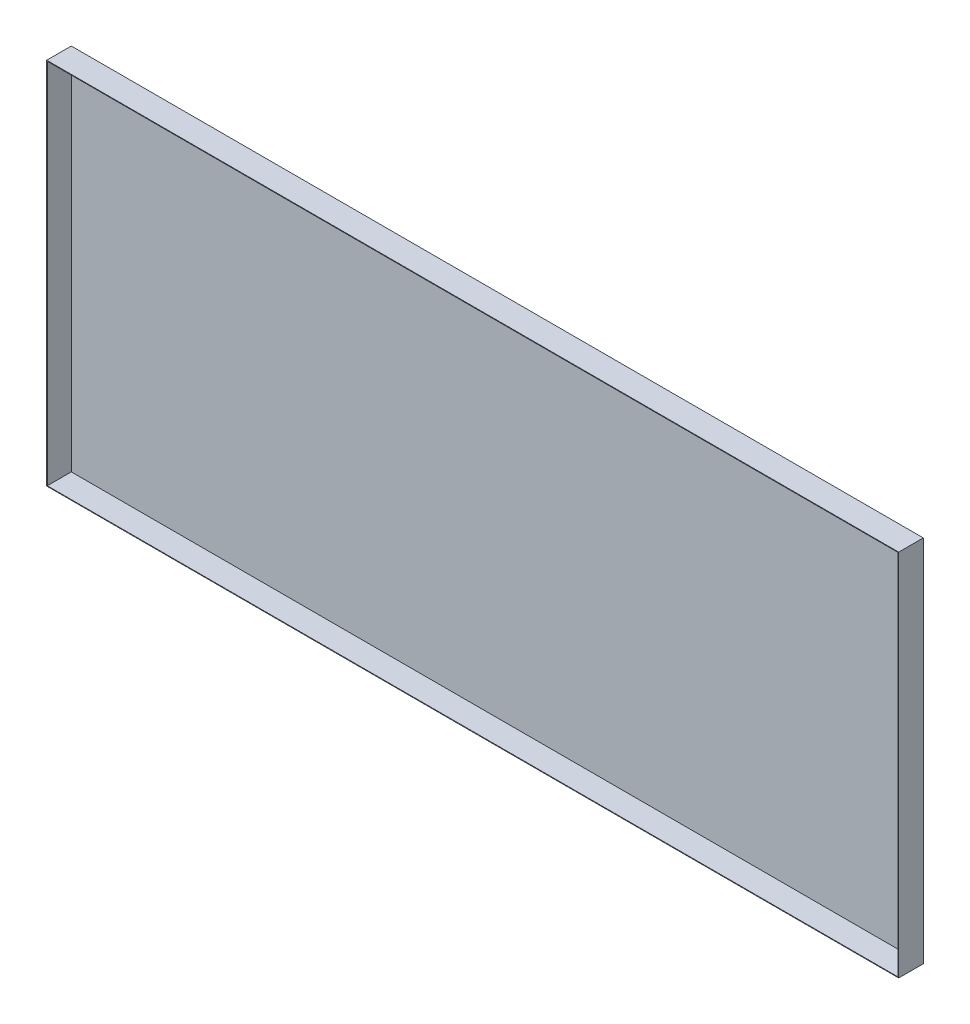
from build123d import *

# Parameters (mm, degrees)
ESQUISSE1_W          = 1386
ESQUISSE1_H          = 600
BASE_EXTRUSION_DEPTH = 40
COQUE1_T             = -1


with BuildPart() as part:
    # Esquisse1 → Base-Extrusion (new body)
    with BuildSketch(Plane.XY):
        with Locations((0, -300)):
            Rectangle(ESQUISSE1_W, ESQUISSE1_H)
    extrude(amount=BASE_EXTRUSION_DEPTH)

    # Coque1
    coque1_openings = [part.faces().sort_by_distance(p)[0] for p in [
        (0, -300, 40),
    ]]
    offset(amount=COQUE1_T, openings=coque1_openings, kind=Kind.INTERSECTION)


solid = part.part
